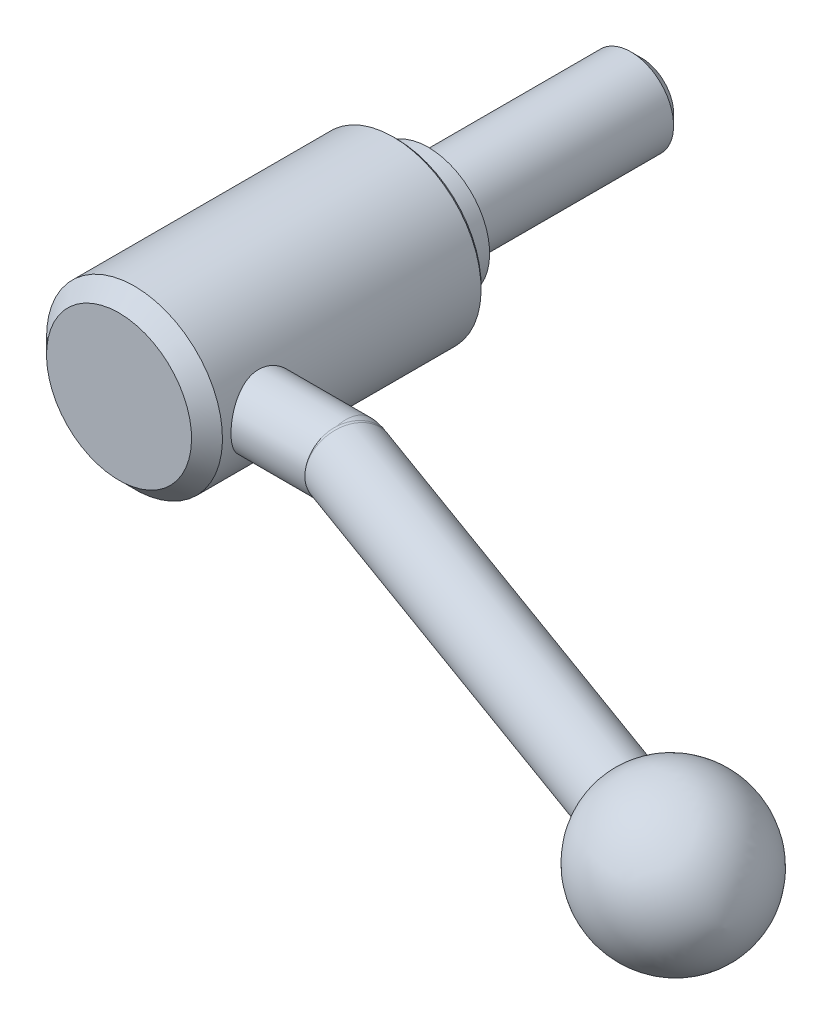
ISO-10303-21;
HEADER;
FILE_DESCRIPTION(('STEP AP214'),'2;1');
FILE_NAME('part.step','',(''),(''),'','','');
FILE_SCHEMA(('AUTOMOTIVE_DESIGN { 1 0 10303 214 1 1 1 1 }'));
ENDSEC;
DATA;
#1=APPLICATION_CONTEXT('core data for automotive mechanical design processes');
#2=APPLICATION_PROTOCOL_DEFINITION('international standard','automotive_design',2000,#1);
#3=PRODUCT_CONTEXT('',#1,'mechanical');
#4=PRODUCT('Part','Part','',(#3));
#5=PRODUCT_RELATED_PRODUCT_CATEGORY('part','',(#4));
#6=PRODUCT_DEFINITION_FORMATION('','',#4);
#7=PRODUCT_DEFINITION_CONTEXT('part definition',#1,'design');
#8=PRODUCT_DEFINITION('design','',#6,#7);
#9=PRODUCT_DEFINITION_SHAPE('','',#8);
#10=(LENGTH_UNIT() NAMED_UNIT(*) SI_UNIT(.MILLI.,.METRE.));
#11=(NAMED_UNIT(*) PLANE_ANGLE_UNIT() SI_UNIT($,.RADIAN.));
#12=(NAMED_UNIT(*) SI_UNIT($,.STERADIAN.) SOLID_ANGLE_UNIT());
#13=UNCERTAINTY_MEASURE_WITH_UNIT(LENGTH_MEASURE(1.E-05),#10,'distance_accuracy_value','');
#14=(GEOMETRIC_REPRESENTATION_CONTEXT(3) GLOBAL_UNCERTAINTY_ASSIGNED_CONTEXT((#13)) GLOBAL_UNIT_ASSIGNED_CONTEXT((#10,
#11,#12)) REPRESENTATION_CONTEXT('',''));
#15=CARTESIAN_POINT('',(0.,0.,0.));
#16=DIRECTION('',(0.,0.,1.));
#17=DIRECTION('',(1.,0.,0.));
#18=AXIS2_PLACEMENT_3D('',#15,#16,#17);
#19=CARTESIAN_POINT('',(0.,0.,0.));
#20=DIRECTION('',(0.,0.,-1.));
#21=DIRECTION('',(0.,1.,0.));
#22=AXIS2_PLACEMENT_3D('',#19,#20,#21);
#23=CYLINDRICAL_SURFACE('',#22,16.5);
#24=CARTESIAN_POINT('',(0.,0.,6.6));
#25=DIRECTION('',(0.,0.,-1.));
#26=DIRECTION('',(0.,1.,0.));
#27=AXIS2_PLACEMENT_3D('',#24,#25,#26);
#28=CIRCLE('',#27,16.5);
#29=CARTESIAN_POINT('',(0.,16.5,6.6));
#30=VERTEX_POINT('',#29);
#31=EDGE_CURVE('E160',#30,#30,#28,.T.);
#32=ORIENTED_EDGE('',*,*,#31,.F.);
#33=EDGE_LOOP('',(#32));
#34=FACE_BOUND('',#33,.T.);
#35=CARTESIAN_POINT('',(15.1657508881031,6.5,47.));
#36=CARTESIAN_POINT('',(15.1657521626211,6.49999870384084,47.1744094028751));
#37=CARTESIAN_POINT('',(15.1687696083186,6.49297069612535,47.3488754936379));
#38=CARTESIAN_POINT('',(15.180743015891,6.4649258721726,47.6965510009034));
#39=CARTESIAN_POINT('',(15.1897026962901,6.44390029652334,47.8697595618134));
#40=CARTESIAN_POINT('',(15.2132851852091,6.38802582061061,48.2139084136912));
#41=CARTESIAN_POINT('',(15.2279195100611,6.35314880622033,48.3848433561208));
#42=CARTESIAN_POINT('',(15.2623783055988,6.26991497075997,48.722930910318));
#43=CARTESIAN_POINT('',(15.2822049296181,6.22155255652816,48.890081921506));
#44=CARTESIAN_POINT('',(15.3263305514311,6.11204204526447,49.2187433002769));
#45=CARTESIAN_POINT('',(15.3506106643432,6.05094779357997,49.3802741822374));
#46=CARTESIAN_POINT('',(15.4029879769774,5.91634808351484,49.6975038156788));
#47=CARTESIAN_POINT('',(15.4310866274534,5.84283790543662,49.8532003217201));
#48=CARTESIAN_POINT('',(15.4902847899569,5.68403460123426,50.1577239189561));
#49=CARTESIAN_POINT('',(15.521382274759,5.59874941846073,50.3065555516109));
#50=CARTESIAN_POINT('',(15.5857773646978,5.41690395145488,50.5967321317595));
#51=CARTESIAN_POINT('',(15.6190757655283,5.32033957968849,50.7380743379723));
#52=CARTESIAN_POINT('',(15.6887204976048,5.11143504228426,51.0193834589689));
#53=CARTESIAN_POINT('',(15.7251359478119,4.99854682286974,51.1589265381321));
#54=CARTESIAN_POINT('',(15.7984684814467,4.76169722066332,51.4281356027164));
#55=CARTESIAN_POINT('',(15.8353855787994,4.6377355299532,51.5578013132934));
#56=CARTESIAN_POINT('',(15.9087724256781,4.37938333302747,51.8065762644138));
#57=CARTESIAN_POINT('',(15.9452419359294,4.24498750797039,51.9256800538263));
#58=CARTESIAN_POINT('',(16.0167582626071,3.96662276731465,52.1524872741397));
#59=CARTESIAN_POINT('',(16.0518055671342,3.82265718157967,52.2601946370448));
#60=CARTESIAN_POINT('',(16.1208941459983,3.52019152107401,52.467462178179));
#61=CARTESIAN_POINT('',(16.1548445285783,3.3613450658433,52.5665481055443));
#62=CARTESIAN_POINT('',(16.2192807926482,3.03521726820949,52.7508716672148));
#63=CARTESIAN_POINT('',(16.2497679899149,2.86793916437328,52.8361145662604));
#64=CARTESIAN_POINT('',(16.306415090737,2.52603369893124,52.9920322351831));
#65=CARTESIAN_POINT('',(16.3325754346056,2.35140708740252,53.062708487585));
#66=CARTESIAN_POINT('',(16.3798001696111,1.99606140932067,53.1888023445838));
#67=CARTESIAN_POINT('',(16.4008648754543,1.81534271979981,53.2442208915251));
#68=CARTESIAN_POINT('',(16.4364052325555,1.45784632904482,53.3369679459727));
#69=CARTESIAN_POINT('',(16.4511444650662,1.28128382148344,53.3750254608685));
#70=CARTESIAN_POINT('',(16.4750042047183,0.925236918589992,53.4363470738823));
#71=CARTESIAN_POINT('',(16.4841250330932,0.745752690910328,53.4596120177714));
#72=CARTESIAN_POINT('',(16.4964855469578,0.38532015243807,53.4910896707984));
#73=CARTESIAN_POINT('',(16.4997269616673,0.204372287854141,53.4993068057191));
#74=CARTESIAN_POINT('',(16.5002398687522,-0.157583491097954,53.500608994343));
#75=CARTESIAN_POINT('',(16.4975115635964,-0.33859140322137,53.4936945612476));
#76=CARTESIAN_POINT('',(16.4864766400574,-0.689328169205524,53.465606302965));
#77=CARTESIAN_POINT('',(16.4784837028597,-0.85913183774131,53.4452341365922));
#78=CARTESIAN_POINT('',(16.4574384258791,-1.19635679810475,53.3912360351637));
#79=CARTESIAN_POINT('',(16.444384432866,-1.36377729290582,53.3576057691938));
#80=CARTESIAN_POINT('',(16.4135516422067,-1.69498665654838,53.2774234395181));
#81=CARTESIAN_POINT('',(16.3957743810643,-1.85877668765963,53.2308755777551));
#82=CARTESIAN_POINT('',(16.3559249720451,-2.18179127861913,53.1252488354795));
#83=CARTESIAN_POINT('',(16.3338511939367,-2.34101407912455,53.0661651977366));
#84=CARTESIAN_POINT('',(16.2855961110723,-2.65615140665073,52.9350157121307));
#85=CARTESIAN_POINT('',(16.2593596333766,-2.81198390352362,52.8627732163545));
#86=CARTESIAN_POINT('',(16.2036445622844,-3.11704287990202,52.7064377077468));
#87=CARTESIAN_POINT('',(16.1741648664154,-3.26626708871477,52.6223406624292));
#88=CARTESIAN_POINT('',(16.1126670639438,-3.55725721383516,52.4428984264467));
#89=CARTESIAN_POINT('',(16.0806487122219,-3.69902240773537,52.3475521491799));
#90=CARTESIAN_POINT('',(16.0148235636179,-3.97435099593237,52.1462241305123));
#91=CARTESIAN_POINT('',(15.9810166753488,-4.10791397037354,52.0402418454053));
#92=CARTESIAN_POINT('',(15.9101988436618,-4.37444690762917,51.8111373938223));
#93=CARTESIAN_POINT('',(15.8731214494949,-4.50682971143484,51.687351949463));
#94=CARTESIAN_POINT('',(15.7988232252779,-4.76074389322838,51.4292307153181));
#95=CARTESIAN_POINT('',(15.7616024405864,-4.88227844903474,51.2948980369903));
#96=CARTESIAN_POINT('',(15.6879834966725,-5.11389804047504,51.0163266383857));
#97=CARTESIAN_POINT('',(15.6515859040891,-5.22397536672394,50.8720813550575));
#98=CARTESIAN_POINT('',(15.5806672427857,-5.43183822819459,50.5746385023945));
#99=CARTESIAN_POINT('',(15.5461454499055,-5.52962852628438,50.4214444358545));
#100=CARTESIAN_POINT('',(15.4790662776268,-5.71475871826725,50.1026478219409));
#101=CARTESIAN_POINT('',(15.4465879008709,-5.80174188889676,49.936821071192));
#102=CARTESIAN_POINT('',(15.3857195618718,-5.96128563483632,49.5977234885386));
#103=CARTESIAN_POINT('',(15.3573279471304,-6.03385204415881,49.4244557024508));
#104=CARTESIAN_POINT('',(15.3055990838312,-6.16388979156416,49.0716641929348));
#105=CARTESIAN_POINT('',(15.2822603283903,-6.22136563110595,48.8921423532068));
#106=CARTESIAN_POINT('',(15.2414756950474,-6.32062540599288,48.5281589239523));
#107=CARTESIAN_POINT('',(15.2240293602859,-6.36241055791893,48.3436977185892));
#108=CARTESIAN_POINT('',(15.1965377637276,-6.42778493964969,47.9824635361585));
#109=CARTESIAN_POINT('',(15.1861129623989,-6.45231123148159,47.8058886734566));
#110=CARTESIAN_POINT('',(15.1714222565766,-6.48677897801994,47.4510697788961));
#111=CARTESIAN_POINT('',(15.1671560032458,-6.4967212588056,47.2728258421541));
#112=CARTESIAN_POINT('',(15.1649343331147,-6.5019054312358,46.9161296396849));
#113=CARTESIAN_POINT('',(15.1669773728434,-6.49715091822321,46.7376774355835));
#114=CARTESIAN_POINT('',(15.1772980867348,-6.47300508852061,46.3819515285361));
#115=CARTESIAN_POINT('',(15.1855756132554,-6.45361411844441,46.2046777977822));
#116=CARTESIAN_POINT('',(15.2074545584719,-6.40187966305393,45.8623519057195));
#117=CARTESIAN_POINT('',(15.2207392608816,-6.37030447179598,45.6971624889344));
#118=CARTESIAN_POINT('',(15.2522135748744,-6.29457395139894,45.3701161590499));
#119=CARTESIAN_POINT('',(15.2704047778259,-6.25041454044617,45.2082603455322));
#120=CARTESIAN_POINT('',(15.3111508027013,-6.1499265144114,44.8889788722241));
#121=CARTESIAN_POINT('',(15.3337047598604,-6.09360031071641,44.7315523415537));
#122=CARTESIAN_POINT('',(15.3825547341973,-5.9692104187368,44.4219440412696));
#123=CARTESIAN_POINT('',(15.4088521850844,-5.90114223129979,44.2697643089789));
#124=CARTESIAN_POINT('',(15.4655807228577,-5.75087055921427,43.9656332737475));
#125=CARTESIAN_POINT('',(15.496133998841,-5.66821518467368,43.8139280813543));
#126=CARTESIAN_POINT('',(15.5596953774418,-5.4913305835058,43.5178983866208));
#127=CARTESIAN_POINT('',(15.5927043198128,-5.39709739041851,43.373576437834));
#128=CARTESIAN_POINT('',(15.6603145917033,-5.19765644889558,43.093084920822));
#129=CARTESIAN_POINT('',(15.6949161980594,-5.09244678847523,42.9569167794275));
#130=CARTESIAN_POINT('',(15.7648419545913,-4.87166967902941,42.6934495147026));
#131=CARTESIAN_POINT('',(15.8001661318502,-4.75610184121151,42.5661507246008));
#132=CARTESIAN_POINT('',(15.8732028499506,-4.50660710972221,42.3123157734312));
#133=CARTESIAN_POINT('',(15.910905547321,-4.37195833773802,42.1864851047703));
#134=CARTESIAN_POINT('',(15.985112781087,-4.09232041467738,41.9466012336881));
#135=CARTESIAN_POINT('',(16.0216176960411,-3.94733457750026,41.8325442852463));
#136=CARTESIAN_POINT('',(16.0924669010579,-3.64776716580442,41.6168903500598));
#137=CARTESIAN_POINT('',(16.1268102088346,-3.4931812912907,41.5152990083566));
#138=CARTESIAN_POINT('',(16.192362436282,-3.17548270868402,41.3254483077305));
#139=CARTESIAN_POINT('',(16.2235726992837,-3.01237370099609,41.2371832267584));
#140=CARTESIAN_POINT('',(16.2819868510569,-2.67872446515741,41.0747287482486));
#141=CARTESIAN_POINT('',(16.3091932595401,-2.50818899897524,41.0005304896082));
#142=CARTESIAN_POINT('',(16.3588360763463,-2.16084294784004,40.8668630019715));
#143=CARTESIAN_POINT('',(16.3812744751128,-1.98403501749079,40.8073876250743));
#144=CARTESIAN_POINT('',(16.4207336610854,-1.62543340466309,40.7037478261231));
#145=CARTESIAN_POINT('',(16.4377556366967,-1.44364082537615,40.6595800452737));
#146=CARTESIAN_POINT('',(16.4658759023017,-1.0764844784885,40.5870294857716));
#147=CARTESIAN_POINT('',(16.4769745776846,-0.89112094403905,40.5586456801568));
#148=CARTESIAN_POINT('',(16.4924035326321,-0.530232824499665,40.5192842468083));
#149=CARTESIAN_POINT('',(16.4971193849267,-0.354832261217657,40.5073144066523));
#150=CARTESIAN_POINT('',(16.5009342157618,-0.003578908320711,40.4976272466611));
#151=CARTESIAN_POINT('',(16.5000333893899,0.172273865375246,40.4999094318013));
#152=CARTESIAN_POINT('',(16.492639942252,0.523072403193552,40.5187002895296));
#153=CARTESIAN_POINT('',(16.4861480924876,0.698018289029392,40.5352070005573));
#154=CARTESIAN_POINT('',(16.4677497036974,1.04571908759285,40.5822707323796));
#155=CARTESIAN_POINT('',(16.4558431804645,1.21847400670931,40.6128277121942));
#156=CARTESIAN_POINT('',(16.427359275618,1.55551611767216,40.6865815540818));
#157=CARTESIAN_POINT('',(16.4109292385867,1.71990302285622,40.7293811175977));
#158=CARTESIAN_POINT('',(16.3736686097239,2.04442213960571,40.8275543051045));
#159=CARTESIAN_POINT('',(16.3528365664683,2.20455292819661,40.8829320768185));
#160=CARTESIAN_POINT('',(16.3072831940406,2.51948953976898,41.0057747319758));
#161=CARTESIAN_POINT('',(16.2825627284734,2.67429653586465,41.0732369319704));
#162=CARTESIAN_POINT('',(16.2298017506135,2.977796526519,41.2197632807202));
#163=CARTESIAN_POINT('',(16.201759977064,3.12648716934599,41.2988318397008));
#164=CARTESIAN_POINT('',(16.1417339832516,3.42320288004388,41.4716706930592));
#165=CARTESIAN_POINT('',(16.1096315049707,3.5709192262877,41.565929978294));
#166=CARTESIAN_POINT('',(16.0433028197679,3.85799821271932,41.7658374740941));
#167=CARTESIAN_POINT('',(16.0090758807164,3.99735794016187,41.8714896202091));
#168=CARTESIAN_POINT('',(15.9393375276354,4.266955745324,42.0935156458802));
#169=CARTESIAN_POINT('',(15.9038258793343,4.39719214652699,42.2098914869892));
#170=CARTESIAN_POINT('',(15.8323930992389,4.647828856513,42.4526787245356));
#171=CARTESIAN_POINT('',(15.796471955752,4.76822888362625,42.5790904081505));
#172=CARTESIAN_POINT('',(15.7229728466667,5.00544246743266,42.8491269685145));
#173=CARTESIAN_POINT('',(15.6854245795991,5.12160881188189,42.9933293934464));
#174=CARTESIAN_POINT('',(15.6119611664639,5.34135661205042,43.2913381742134));
#175=CARTESIAN_POINT('',(15.5760454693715,5.44494233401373,43.4451412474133));
#176=CARTESIAN_POINT('',(15.5068861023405,5.63889116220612,43.76158008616));
#177=CARTESIAN_POINT('',(15.4736440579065,5.72924625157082,43.9242211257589));
#178=CARTESIAN_POINT('',(15.4109193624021,5.89588782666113,44.2571658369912));
#179=CARTESIAN_POINT('',(15.3814348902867,5.9721811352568,44.427465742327));
#180=CARTESIAN_POINT('',(15.3295715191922,6.10399903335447,44.7594125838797));
#181=CARTESIAN_POINT('',(15.3067961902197,6.16075841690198,44.9205080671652));
#182=CARTESIAN_POINT('',(15.2658533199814,6.26152405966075,45.2471430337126));
#183=CARTESIAN_POINT('',(15.2476836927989,6.30553609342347,45.4126804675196));
#184=CARTESIAN_POINT('',(15.2165340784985,6.38033934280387,45.7467976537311));
#185=CARTESIAN_POINT('',(15.2035424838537,6.41116014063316,45.9153697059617));
#186=CARTESIAN_POINT('',(15.183110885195,6.45939917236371,46.2546841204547));
#187=CARTESIAN_POINT('',(15.1756675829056,6.4768253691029,46.4254251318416));
#188=CARTESIAN_POINT('',(15.1693292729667,6.49164558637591,46.6637445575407));
#189=CARTESIAN_POINT('',(15.1679883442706,6.49477751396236,46.7309454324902));
#190=CARTESIAN_POINT('',(15.1661988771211,6.49895503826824,46.8654280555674));
#191=CARTESIAN_POINT('',(15.1657503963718,6.50000050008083,46.9327098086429));
#192=CARTESIAN_POINT('',(15.1657508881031,6.5,47.));
#193=B_SPLINE_CURVE_WITH_KNOTS('',3,(#35,#36,#37,#38,#39,#40,#41,#42,#43,#44,#45,#46,#47,#48,
#49,#50,#51,#52,#53,#54,#55,#56,#57,#58,#59,#60,#61,#62,#63,#64,#65,#66,#67,#68,#69,#70,#71,#72,
#73,#74,#75,#76,#77,#78,#79,#80,#81,#82,#83,#84,#85,#86,#87,#88,#89,#90,#91,#92,#93,#94,#95,#96,
#97,#98,#99,#100,#101,#102,#103,#104,#105,#106,#107,#108,#109,#110,#111,#112,#113,#114,#115,
#116,#117,#118,#119,#120,#121,#122,#123,#124,#125,#126,#127,#128,#129,#130,#131,#132,#133,#134,
#135,#136,#137,#138,#139,#140,#141,#142,#143,#144,#145,#146,#147,#148,#149,#150,#151,#152,#153,
#154,#155,#156,#157,#158,#159,#160,#161,#162,#163,#164,#165,#166,#167,#168,#169,#170,#171,#172,
#173,#174,#175,#176,#177,#178,#179,#180,#181,#182,#183,#184,#185,#186,#187,#188,#189,#190,#191,
#192),.UNSPECIFIED.,.T.,.F.,(4,2,2,2,2,2,2,2,2,2,2,2,2,2,2,2,2,2,2,2,2,2,2,2,2,2,2,2,2,2,2,2,2,
2,2,2,2,2,2,2,2,2,2,2,2,2,2,2,2,2,2,2,2,2,2,2,2,2,2,2,2,2,2,2,2,2,2,2,2,2,2,2,2,2,2,2,2,2,4),
(0.,0.523159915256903,1.04664752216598,1.5712031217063,2.09597660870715,2.61857420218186,
3.14137090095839,3.66381663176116,4.18645228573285,4.73527747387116,5.28411792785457,
5.83324001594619,6.38217202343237,6.95226912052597,7.52214888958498,8.09197063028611,
8.66175716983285,9.20471085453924,9.74763349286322,10.2903964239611,10.8331409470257,
11.3461618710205,11.8593505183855,12.3723724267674,12.8855893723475,13.4062856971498,
13.9271595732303,14.4480838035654,14.9690346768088,15.5233891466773,16.0775806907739,
16.6321427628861,17.186489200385,17.755918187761,18.3251162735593,18.894144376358,
19.4631283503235,19.9981572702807,20.533155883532,21.0680236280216,21.6028787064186,
22.1084143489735,22.6141141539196,23.11971382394,23.6255076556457,24.1512658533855,
24.6772046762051,25.2032352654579,25.7292856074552,26.2929535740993,26.8564416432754,
27.4201839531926,27.9836835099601,28.5468269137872,29.1097347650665,29.6725190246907,
30.235266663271,30.7622239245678,31.2891628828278,31.8160291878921,32.3428939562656,
32.8542954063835,33.3658657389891,33.8773226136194,34.3889743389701,34.9228229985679,
35.4568566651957,35.990988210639,36.5251350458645,37.0912887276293,37.6572498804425,
38.2235525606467,38.7895797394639,39.3059532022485,39.8220923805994,40.3370679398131,
40.851737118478,41.0535682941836,41.2554125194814),.UNSPECIFIED.);
#194=CARTESIAN_POINT('',(15.1657508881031,6.5,47.));
#195=VERTEX_POINT('',#194);
#196=EDGE_CURVE('E79',#195,#195,#193,.T.);
#197=ORIENTED_EDGE('',*,*,#196,.F.);
#198=EDGE_LOOP('',(#197));
#199=FACE_BOUND('',#198,.T.);
#200=CARTESIAN_POINT('',(0.,0.,55.1));
#201=DIRECTION('',(0.,0.,-1.));
#202=DIRECTION('',(0.,1.,0.));
#203=AXIS2_PLACEMENT_3D('',#200,#201,#202);
#204=CIRCLE('',#203,16.5);
#205=CARTESIAN_POINT('',(0.,16.5,55.1));
#206=VERTEX_POINT('',#205);
#207=EDGE_CURVE('E163',#206,#206,#204,.T.);
#208=ORIENTED_EDGE('',*,*,#207,.T.);
#209=EDGE_LOOP('',(#208));
#210=FACE_BOUND('',#209,.T.);
#211=ADVANCED_FACE('F15',(#34,#199,#210),#23,.T.);
#212=CARTESIAN_POINT('',(0.,0.,58.));
#213=DIRECTION('',(0.,0.,-1.));
#214=DIRECTION('',(0.,1.,0.));
#215=AXIS2_PLACEMENT_3D('',#212,#213,#214);
#216=PLANE('',#215);
#217=CARTESIAN_POINT('',(0.,0.,58.));
#218=DIRECTION('',(0.,0.,-1.));
#219=DIRECTION('',(0.,1.,0.));
#220=AXIS2_PLACEMENT_3D('',#217,#218,#219);
#221=CIRCLE('',#220,13.6);
#222=CARTESIAN_POINT('',(0.,13.6,58.));
#223=VERTEX_POINT('',#222);
#224=EDGE_CURVE('E88',#223,#223,#221,.T.);
#225=ORIENTED_EDGE('',*,*,#224,.F.);
#226=EDGE_LOOP('',(#225));
#227=FACE_BOUND('',#226,.T.);
#228=ADVANCED_FACE('F63',(#227),#216,.F.);
#229=CARTESIAN_POINT('',(0.,0.,58.));
#230=DIRECTION('',(0.,0.,-1.));
#231=DIRECTION('',(0.,1.,0.));
#232=AXIS2_PLACEMENT_3D('',#229,#230,#231);
#233=CONICAL_SURFACE('',#232,13.6,0.785398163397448);
#234=ORIENTED_EDGE('',*,*,#207,.F.);
#235=EDGE_LOOP('',(#234));
#236=FACE_BOUND('',#235,.T.);
#237=ORIENTED_EDGE('',*,*,#224,.T.);
#238=EDGE_LOOP('',(#237));
#239=FACE_BOUND('',#238,.T.);
#240=ADVANCED_FACE('F69',(#236,#239),#233,.T.);
#241=CARTESIAN_POINT('',(0.,0.,6.6));
#242=DIRECTION('',(0.,0.,1.));
#243=DIRECTION('',(0.,-1.,0.));
#244=AXIS2_PLACEMENT_3D('',#241,#242,#243);
#245=CONICAL_SURFACE('',#244,16.5,0.785398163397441);
#246=CARTESIAN_POINT('',(0.,0.,6.));
#247=DIRECTION('',(0.,0.,-1.));
#248=DIRECTION('',(0.,1.,0.));
#249=AXIS2_PLACEMENT_3D('',#246,#247,#248);
#250=CIRCLE('',#249,15.9);
#251=CARTESIAN_POINT('',(0.,15.9,6.));
#252=VERTEX_POINT('',#251);
#253=EDGE_CURVE('E154',#252,#252,#250,.T.);
#254=ORIENTED_EDGE('',*,*,#253,.F.);
#255=EDGE_LOOP('',(#254));
#256=FACE_BOUND('',#255,.T.);
#257=ORIENTED_EDGE('',*,*,#31,.T.);
#258=EDGE_LOOP('',(#257));
#259=FACE_BOUND('',#258,.T.);
#260=ADVANCED_FACE('F76',(#256,#259),#245,.T.);
#261=CARTESIAN_POINT('',(15.9,0.,6.));
#262=DIRECTION('',(0.,0.,1.));
#263=DIRECTION('',(0.,-1.,0.));
#264=AXIS2_PLACEMENT_3D('',#261,#262,#263);
#265=PLANE('',#264);
#266=CARTESIAN_POINT('',(0.,0.,6.));
#267=DIRECTION('',(0.,0.,-1.));
#268=DIRECTION('',(0.,1.,0.));
#269=AXIS2_PLACEMENT_3D('',#266,#267,#268);
#270=CIRCLE('',#269,11.5);
#271=CARTESIAN_POINT('',(0.,11.5,6.));
#272=VERTEX_POINT('',#271);
#273=EDGE_CURVE('E150',#272,#272,#270,.T.);
#274=ORIENTED_EDGE('',*,*,#273,.F.);
#275=EDGE_LOOP('',(#274));
#276=FACE_BOUND('',#275,.T.);
#277=ORIENTED_EDGE('',*,*,#253,.T.);
#278=EDGE_LOOP('',(#277));
#279=FACE_BOUND('',#278,.T.);
#280=ADVANCED_FACE('F177',(#276,#279),#265,.F.);
#281=CARTESIAN_POINT('',(0.,0.,0.));
#282=DIRECTION('',(0.,0.,-1.));
#283=DIRECTION('',(0.,1.,0.));
#284=AXIS2_PLACEMENT_3D('',#281,#282,#283);
#285=CYLINDRICAL_SURFACE('',#284,11.5);
#286=CARTESIAN_POINT('',(0.,0.,0.));
#287=DIRECTION('',(0.,0.,-1.));
#288=DIRECTION('',(0.,1.,0.));
#289=AXIS2_PLACEMENT_3D('',#286,#287,#288);
#290=CIRCLE('',#289,11.5);
#291=CARTESIAN_POINT('',(0.,11.5,0.));
#292=VERTEX_POINT('',#291);
#293=EDGE_CURVE('E147',#292,#292,#290,.T.);
#294=ORIENTED_EDGE('',*,*,#293,.F.);
#295=EDGE_LOOP('',(#294));
#296=FACE_BOUND('',#295,.T.);
#297=ORIENTED_EDGE('',*,*,#273,.T.);
#298=EDGE_LOOP('',(#297));
#299=FACE_BOUND('',#298,.T.);
#300=ADVANCED_FACE('F144',(#296,#299),#285,.T.);
#301=CARTESIAN_POINT('',(11.5,0.,0.));
#302=DIRECTION('',(0.,0.,1.));
#303=DIRECTION('',(0.,-1.,0.));
#304=AXIS2_PLACEMENT_3D('',#301,#302,#303);
#305=PLANE('',#304);
#306=CARTESIAN_POINT('',(0.,0.,0.));
#307=DIRECTION('',(0.,0.,-1.));
#308=DIRECTION('',(0.,1.,0.));
#309=AXIS2_PLACEMENT_3D('',#306,#307,#308);
#310=CIRCLE('',#309,8.);
#311=CARTESIAN_POINT('',(0.,8.,0.));
#312=VERTEX_POINT('',#311);
#313=EDGE_CURVE('E134',#312,#312,#310,.T.);
#314=ORIENTED_EDGE('',*,*,#313,.F.);
#315=EDGE_LOOP('',(#314));
#316=FACE_BOUND('',#315,.T.);
#317=ORIENTED_EDGE('',*,*,#293,.T.);
#318=EDGE_LOOP('',(#317));
#319=FACE_BOUND('',#318,.T.);
#320=ADVANCED_FACE('F96',(#316,#319),#305,.F.);
#321=CARTESIAN_POINT('',(38.,0.,47.));
#322=DIRECTION('',(1.,0.,0.));
#323=DIRECTION('',(0.,1.,0.));
#324=AXIS2_PLACEMENT_3D('',#321,#322,#323);
#325=CYLINDRICAL_SURFACE('',#324,6.5);
#326=CARTESIAN_POINT('',(31.5002,-6.28048269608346,48.6749737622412));
#327=CARTESIAN_POINT('',(31.4701911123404,-6.25848550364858,48.7574684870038));
#328=CARTESIAN_POINT('',(31.4414052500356,-6.2347500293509,48.8399237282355));
#329=CARTESIAN_POINT('',(31.3859523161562,-6.18381246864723,49.0044625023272));
#330=CARTESIAN_POINT('',(31.3592849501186,-6.15661086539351,49.0865460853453));
#331=CARTESIAN_POINT('',(31.2819864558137,-6.06984393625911,49.3317442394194));
#332=CARTESIAN_POINT('',(31.234026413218,-6.00509209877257,49.4938982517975));
#333=CARTESIAN_POINT('',(31.1437652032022,-5.86212891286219,49.8135555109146));
#334=CARTESIAN_POINT('',(31.1014588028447,-5.78393016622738,49.971062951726));
#335=CARTESIAN_POINT('',(31.0215196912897,-5.61443273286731,50.2801227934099));
#336=CARTESIAN_POINT('',(30.9838873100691,-5.52313312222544,50.4316747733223));
#337=CARTESIAN_POINT('',(30.9127228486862,-5.32805112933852,50.7273614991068));
#338=CARTESIAN_POINT('',(30.8791877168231,-5.22427815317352,50.871501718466));
#339=CARTESIAN_POINT('',(30.815774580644,-5.00483968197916,51.1512875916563));
#340=CARTESIAN_POINT('',(30.7858966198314,-4.88917404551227,51.2869331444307));
#341=CARTESIAN_POINT('',(30.7295154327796,-4.64671898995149,51.548605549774));
#342=CARTESIAN_POINT('',(30.7030116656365,-4.51993135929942,51.6746339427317));
#343=CARTESIAN_POINT('',(30.6531671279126,-4.25605741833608,51.9160918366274));
#344=CARTESIAN_POINT('',(30.6298263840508,-4.1189710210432,52.0315212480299));
#345=CARTESIAN_POINT('',(30.5859306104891,-3.83395076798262,52.2520111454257));
#346=CARTESIAN_POINT('',(30.5654071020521,-3.68591886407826,52.3569512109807));
#347=CARTESIAN_POINT('',(30.527316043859,-3.38127311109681,52.5542722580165));
#348=CARTESIAN_POINT('',(30.5097495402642,-3.22465625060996,52.6466487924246));
#349=CARTESIAN_POINT('',(30.4775004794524,-2.90402878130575,52.8180456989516));
#350=CARTESIAN_POINT('',(30.4628174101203,-2.74001949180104,52.8970684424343));
#351=CARTESIAN_POINT('',(30.4362651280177,-2.40569424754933,53.0411738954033));
#352=CARTESIAN_POINT('',(30.424396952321,-2.23537599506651,53.1062514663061));
#353=CARTESIAN_POINT('',(30.4035252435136,-1.89117431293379,53.2214241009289));
#354=CARTESIAN_POINT('',(30.3944984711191,-1.71733288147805,53.2716404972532));
#355=CARTESIAN_POINT('',(30.3791416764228,-1.3658896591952,53.3574425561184));
#356=CARTESIAN_POINT('',(30.3728126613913,-1.18828648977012,53.3930227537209));
#357=CARTESIAN_POINT('',(30.3628391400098,-0.830755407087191,53.4492305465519));
#358=CARTESIAN_POINT('',(30.3591931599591,-0.650828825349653,53.4698663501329));
#359=CARTESIAN_POINT('',(30.3545680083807,-0.289765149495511,53.496061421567));
#360=CARTESIAN_POINT('',(30.3535900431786,-0.108627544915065,53.5016138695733));
#361=CARTESIAN_POINT('',(30.3542996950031,0.252555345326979,53.4975893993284));
#362=CARTESIAN_POINT('',(30.355973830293,0.432601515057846,53.4880890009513));
#363=CARTESIAN_POINT('',(30.3619660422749,0.79115770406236,53.4541833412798));
#364=CARTESIAN_POINT('',(30.3662829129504,0.969668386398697,53.429784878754));
#365=CARTESIAN_POINT('',(30.3775753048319,1.32405576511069,53.3662625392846));
#366=CARTESIAN_POINT('',(30.384552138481,1.49993111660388,53.3271313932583));
#367=CARTESIAN_POINT('',(30.4011832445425,1.84764570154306,53.2344660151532));
#368=CARTESIAN_POINT('',(30.4108365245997,2.01948640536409,53.1809371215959));
#369=CARTESIAN_POINT('',(30.4328583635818,2.35804742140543,53.0598634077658));
#370=CARTESIAN_POINT('',(30.4452278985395,2.52476586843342,52.9923135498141));
#371=CARTESIAN_POINT('',(30.4727213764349,2.85178734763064,52.843761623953));
#372=CARTESIAN_POINT('',(30.4878443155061,3.01209269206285,52.7627644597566));
#373=CARTESIAN_POINT('',(30.5209144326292,3.32526997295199,52.5879110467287));
#374=CARTESIAN_POINT('',(30.5388622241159,3.47814028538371,52.4940520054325));
#375=CARTESIAN_POINT('',(30.5776589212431,3.77530504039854,52.2942532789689));
#376=CARTESIAN_POINT('',(30.5985068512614,3.91960234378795,52.1883176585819));
#377=CARTESIAN_POINT('',(30.6433408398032,4.19941993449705,51.9645872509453));
#378=CARTESIAN_POINT('',(30.6673426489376,4.33489069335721,51.8467336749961));
#379=CARTESIAN_POINT('',(30.7185603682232,4.59531298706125,51.6005655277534));
#380=CARTESIAN_POINT('',(30.7457763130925,4.72026440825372,51.4722508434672));
#381=CARTESIAN_POINT('',(30.8036465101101,4.95882988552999,51.20617837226));
#382=CARTESIAN_POINT('',(30.8343011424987,5.07244268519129,51.0684195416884));
#383=CARTESIAN_POINT('',(30.8993555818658,5.28757920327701,50.7846019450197));
#384=CARTESIAN_POINT('',(30.9337552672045,5.38910331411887,50.6385434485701));
#385=CARTESIAN_POINT('',(31.0048466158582,5.5744837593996,50.3471450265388));
#386=CARTESIAN_POINT('',(31.0413260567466,5.65898432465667,50.2021627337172));
#387=CARTESIAN_POINT('',(31.1186048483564,5.81610839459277,49.9070309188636));
#388=CARTESIAN_POINT('',(31.1594036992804,5.88873327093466,49.7568819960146));
#389=CARTESIAN_POINT('',(31.2461889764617,6.0218129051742,49.4526179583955));
#390=CARTESIAN_POINT('',(31.2921778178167,6.08226196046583,49.2985010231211));
#391=CARTESIAN_POINT('',(31.366062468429,6.16360062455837,49.0656236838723));
#392=CARTESIAN_POINT('',(31.3915152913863,6.18916346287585,48.9876924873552));
#393=CARTESIAN_POINT('',(31.4443438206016,6.23716716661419,48.8315099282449));
#394=CARTESIAN_POINT('',(31.4717197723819,6.25960763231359,48.753258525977));
#395=CARTESIAN_POINT('',(31.5001999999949,6.28048269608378,48.6749737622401));
#396=B_SPLINE_CURVE_WITH_KNOTS('',3,(#326,#327,#328,#329,#330,#331,#332,#333,#334,#335,#336,
#337,#338,#339,#340,#341,#342,#343,#344,#345,#346,#347,#348,#349,#350,#351,#352,#353,#354,#355,
#356,#357,#358,#359,#360,#361,#362,#363,#364,#365,#366,#367,#368,#369,#370,#371,#372,#373,#374,
#375,#376,#377,#378,#379,#380,#381,#382,#383,#384,#385,#386,#387,#388,#389,#390,#391,#392,#393,
#394,#395),.UNSPECIFIED.,.F.,.F.,(4,2,2,2,2,2,2,2,2,2,2,2,2,2,2,2,2,2,2,2,2,2,2,2,2,2,2,2,2,2,2,
2,2,2,4),(0.,0.27143395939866,0.542830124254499,1.08532167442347,1.62730757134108,
2.16933170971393,2.71094964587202,3.25257402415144,3.79411146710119,4.3356534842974,
4.88283172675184,5.43020315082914,5.97747727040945,6.52495270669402,7.06782653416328,
7.61090287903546,8.15368070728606,8.69670390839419,9.23697554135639,9.77700080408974,
10.3172928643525,10.8573848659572,11.3976712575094,11.9377610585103,12.4779683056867,
13.0179942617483,13.5608276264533,14.1036668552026,14.6465661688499,15.1894478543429,
15.7040975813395,16.2186878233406,16.733518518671,16.9910761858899,17.2486667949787),.UNSPECIFIED.);
#397=CARTESIAN_POINT('',(31.5,-6.28033613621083,48.6755232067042));
#398=VERTEX_POINT('',#397);
#399=CARTESIAN_POINT('',(30.3538746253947,0.,53.5));
#400=VERTEX_POINT('',#399);
#401=EDGE_CURVE('E31',#398,#400,#396,.T.);
#402=ORIENTED_EDGE('',*,*,#401,.T.);
#403=CARTESIAN_POINT('',(31.5,6.28033613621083,48.6755232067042));
#404=VERTEX_POINT('',#403);
#405=EDGE_CURVE('E101',#400,#404,#396,.T.);
#406=ORIENTED_EDGE('',*,*,#405,.T.);
#407=CARTESIAN_POINT('',(31.5,0.,47.));
#408=DIRECTION('',(1.,0.,0.));
#409=DIRECTION('',(0.,1.,0.));
#410=AXIS2_PLACEMENT_3D('',#407,#408,#409);
#411=CIRCLE('',#410,6.5);
#412=EDGE_CURVE('E111',#398,#404,#411,.T.);
#413=ORIENTED_EDGE('',*,*,#412,.F.);
#414=EDGE_LOOP('',(#402,#406,#413));
#415=FACE_BOUND('',#414,.T.);
#416=ORIENTED_EDGE('',*,*,#196,.T.);
#417=EDGE_LOOP('',(#416));
#418=FACE_BOUND('',#417,.T.);
#419=ADVANCED_FACE('F90',(#415,#418),#325,.T.);
#420=CARTESIAN_POINT('',(31.5,0.,47.));
#421=DIRECTION('',(1.,0.,0.));
#422=DIRECTION('',(0.,0.,-1.));
#423=AXIS2_PLACEMENT_3D('',#420,#421,#422);
#424=SPHERICAL_SURFACE('',#423,6.5);
#425=CARTESIAN_POINT('',(32.0385027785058,0.,47.1959989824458));
#426=DIRECTION('',(0.939692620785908,0.,0.342020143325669));
#427=DIRECTION('',(-0.342020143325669,0.,0.939692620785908));
#428=AXIS2_PLACEMENT_3D('',#425,#426,#427);
#429=CIRCLE('',#428,6.47468911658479);
#430=EDGE_CURVE('E38',#398,#404,#429,.T.);
#431=ORIENTED_EDGE('',*,*,#430,.F.);
#432=ORIENTED_EDGE('',*,*,#412,.T.);
#433=EDGE_LOOP('',(#431,#432));
#434=FACE_BOUND('',#433,.T.);
#435=ADVANCED_FACE('F95',(#434),#424,.T.);
#436=CARTESIAN_POINT('',(32.5770055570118,0.,47.3919979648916));
#437=DIRECTION('',(0.939692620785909,0.,0.342020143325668));
#438=DIRECTION('',(-0.342020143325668,0.,0.939692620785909));
#439=AXIS2_PLACEMENT_3D('',#436,#437,#438);
#440=SPHERICAL_SURFACE('',#439,6.5);
#441=ORIENTED_EDGE('',*,*,#401,.F.);
#442=ORIENTED_EDGE('',*,*,#430,.T.);
#443=ORIENTED_EDGE('',*,*,#405,.F.);
#444=CARTESIAN_POINT('',(32.5770055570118,0.,47.3919979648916));
#445=DIRECTION('',(0.939692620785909,0.,0.342020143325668));
#446=DIRECTION('',(-0.342020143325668,0.,0.939692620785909));
#447=AXIS2_PLACEMENT_3D('',#444,#445,#446);
#448=CIRCLE('',#447,6.5);
#449=EDGE_CURVE('E109',#400,#400,#448,.T.);
#450=ORIENTED_EDGE('',*,*,#449,.F.);
#451=EDGE_LOOP('',(#441,#442,#443,#450));
#452=FACE_BOUND('',#451,.T.);
#453=ADVANCED_FACE('F113',(#452),#440,.T.);
#454=CARTESIAN_POINT('',(143.071394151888,0.,87.6086664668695));
#455=DIRECTION('',(0.939692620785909,0.,0.342020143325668));
#456=DIRECTION('',(-0.342020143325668,0.,0.939692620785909));
#457=AXIS2_PLACEMENT_3D('',#454,#455,#456);
#458=CYLINDRICAL_SURFACE('',#457,6.5);
#459=CARTESIAN_POINT('',(116.052479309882,0.,77.774585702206));
#460=DIRECTION('',(0.939692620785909,0.,0.342020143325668));
#461=DIRECTION('',(-0.342020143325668,0.,0.939692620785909));
#462=AXIS2_PLACEMENT_3D('',#459,#460,#461);
#463=CIRCLE('',#462,6.5);
#464=CARTESIAN_POINT('',(113.829348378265,0.,83.8825877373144));
#465=VERTEX_POINT('',#464);
#466=EDGE_CURVE('E125',#465,#465,#463,.T.);
#467=ORIENTED_EDGE('',*,*,#466,.F.);
#468=EDGE_LOOP('',(#467));
#469=FACE_BOUND('',#468,.T.);
#470=ORIENTED_EDGE('',*,*,#449,.T.);
#471=EDGE_LOOP('',(#470));
#472=FACE_BOUND('',#471,.T.);
#473=ADVANCED_FACE('F58',(#469,#472),#458,.T.);
#474=CARTESIAN_POINT('',(113.829348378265,0.,83.8825877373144));
#475=DIRECTION('',(0.939692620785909,0.,0.342020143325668));
#476=DIRECTION('',(-0.342020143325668,0.,0.939692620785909));
#477=AXIS2_PLACEMENT_3D('',#474,#475,#476);
#478=PLANE('',#477);
#479=CARTESIAN_POINT('',(116.052479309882,0.,77.774585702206));
#480=DIRECTION('',(0.939692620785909,0.,0.342020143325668));
#481=DIRECTION('',(-0.342020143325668,0.,0.939692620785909));
#482=AXIS2_PLACEMENT_3D('',#479,#480,#481);
#483=CIRCLE('',#482,8.37359520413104);
#484=CARTESIAN_POINT('',(113.188541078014,0.,85.6431913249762));
#485=VERTEX_POINT('',#484);
#486=EDGE_CURVE('E131',#485,#485,#483,.T.);
#487=ORIENTED_EDGE('',*,*,#486,.F.);
#488=EDGE_LOOP('',(#487));
#489=FACE_BOUND('',#488,.T.);
#490=ORIENTED_EDGE('',*,*,#466,.T.);
#491=EDGE_LOOP('',(#490));
#492=FACE_BOUND('',#491,.T.);
#493=ADVANCED_FACE('F47',(#489,#492),#478,.F.);
#494=CARTESIAN_POINT('',(128.5,0.,81.));
#495=DIRECTION('',(0.,1.,0.));
#496=DIRECTION('',(-0.342020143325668,0.,0.939692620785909));
#497=AXIS2_PLACEMENT_3D('',#494,#495,#496);
#498=CIRCLE('',#497,16.);
#499=TRIMMED_CURVE('',#498,(PARAMETER_VALUE(-1.49407077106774)),
(PARAMETER_VALUE(1.49407077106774)),.T.,.PARAMETER.);
#500=CARTESIAN_POINT('',(128.080544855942,0.,82.1524435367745));
#501=DIRECTION('',(0.939692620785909,0.,0.342020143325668));
#502=AXIS1_PLACEMENT('',#500,#501);
#503=SURFACE_OF_REVOLUTION('',#499,#502);
#504=ORIENTED_EDGE('',*,*,#486,.T.);
#505=EDGE_LOOP('',(#504));
#506=FACE_BOUND('',#505,.T.);
#507=CARTESIAN_POINT('',(143.071394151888,0.,87.6086664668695));
#508=VERTEX_POINT('',#507);
#509=VERTEX_LOOP('',#508);
#510=FACE_BOUND('',#509,.T.);
#511=ADVANCED_FACE('F44',(#506,#510),#503,.T.);
#512=CARTESIAN_POINT('',(0.,0.,23.));
#513=DIRECTION('',(0.,0.,-1.));
#514=DIRECTION('',(-1.,0.,0.));
#515=AXIS2_PLACEMENT_3D('',#512,#513,#514);
#516=CYLINDRICAL_SURFACE('',#515,8.);
#517=CARTESIAN_POINT('',(0.,0.,-38.));
#518=DIRECTION('',(0.,0.,-1.));
#519=DIRECTION('',(-1.,0.,0.));
#520=AXIS2_PLACEMENT_3D('',#517,#518,#519);
#521=CIRCLE('',#520,8.);
#522=CARTESIAN_POINT('',(-8.,0.,-38.));
#523=VERTEX_POINT('',#522);
#524=EDGE_CURVE('E9',#523,#523,#521,.F.);
#525=ORIENTED_EDGE('',*,*,#524,.T.);
#526=EDGE_LOOP('',(#525));
#527=FACE_BOUND('',#526,.T.);
#528=ORIENTED_EDGE('',*,*,#313,.T.);
#529=EDGE_LOOP('',(#528));
#530=FACE_BOUND('',#529,.T.);
#531=ADVANCED_FACE('F46',(#527,#530),#516,.T.);
#532=CARTESIAN_POINT('',(0.,0.,-40.));
#533=DIRECTION('',(0.,0.,-1.));
#534=DIRECTION('',(-1.,0.,0.));
#535=AXIS2_PLACEMENT_3D('',#532,#533,#534);
#536=PLANE('',#535);
#537=CARTESIAN_POINT('',(0.,0.,-40.));
#538=DIRECTION('',(0.,0.,-1.));
#539=DIRECTION('',(-1.,0.,0.));
#540=AXIS2_PLACEMENT_3D('',#537,#538,#539);
#541=CIRCLE('',#540,6.);
#542=CARTESIAN_POINT('',(-6.,0.,-40.));
#543=VERTEX_POINT('',#542);
#544=EDGE_CURVE('E24',#543,#543,#541,.T.);
#545=ORIENTED_EDGE('',*,*,#544,.T.);
#546=EDGE_LOOP('',(#545));
#547=FACE_BOUND('',#546,.T.);
#548=ADVANCED_FACE('F55',(#547),#536,.T.);
#549=CARTESIAN_POINT('',(0.,0.,-40.));
#550=DIRECTION('',(0.,0.,1.));
#551=DIRECTION('',(1.,0.,0.));
#552=AXIS2_PLACEMENT_3D('',#549,#550,#551);
#553=CONICAL_SURFACE('',#552,6.,0.785398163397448);
#554=ORIENTED_EDGE('',*,*,#524,.F.);
#555=EDGE_LOOP('',(#554));
#556=FACE_BOUND('',#555,.T.);
#557=ORIENTED_EDGE('',*,*,#544,.F.);
#558=EDGE_LOOP('',(#557));
#559=FACE_BOUND('',#558,.T.);
#560=ADVANCED_FACE('F17',(#556,#559),#553,.T.);
#561=CLOSED_SHELL('',(#211,#228,#240,#260,#280,#300,#320,#419,#435,#453,#473,#493,#511,#531,
#548,#560));
#562=MANIFOLD_SOLID_BREP('B1',#561);
#563=ADVANCED_BREP_SHAPE_REPRESENTATION('',(#18,#562),#14);
#564=SHAPE_DEFINITION_REPRESENTATION(#9,#563);
ENDSEC;
END-ISO-10303-21;
